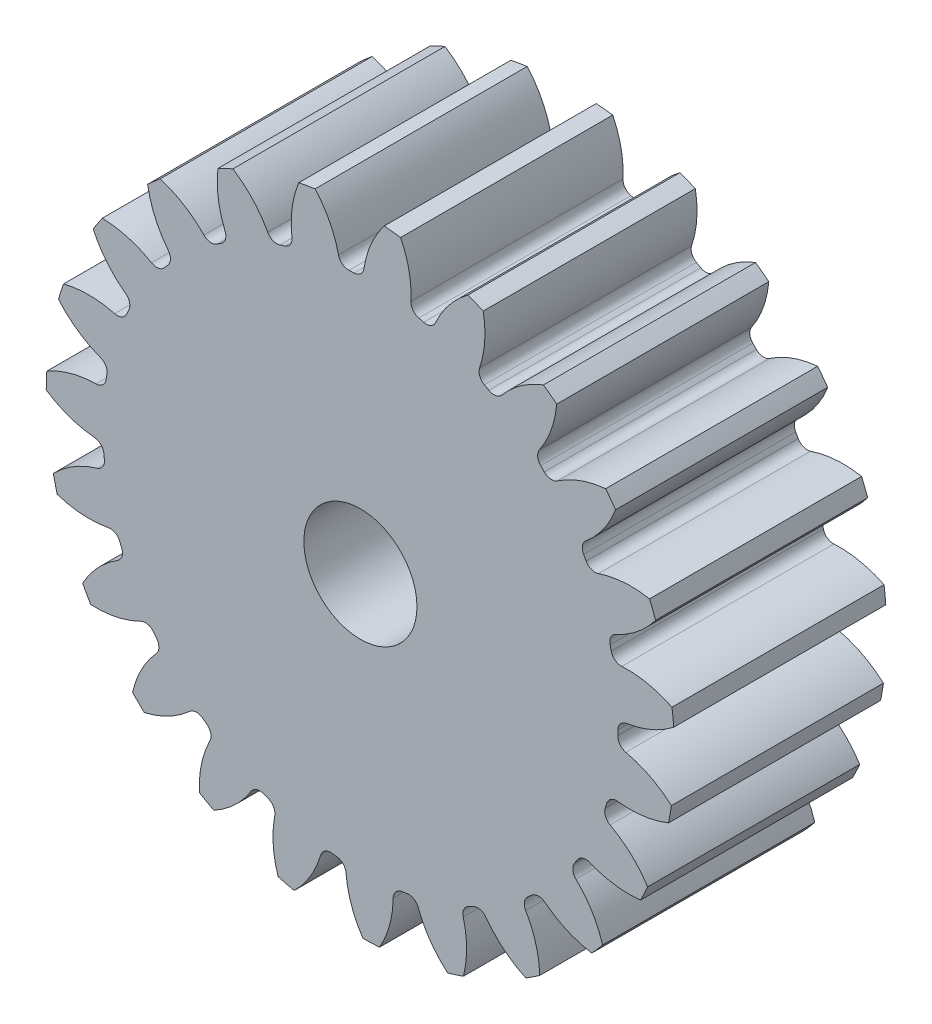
from build123d import *

# Parameters (mm, degrees)
SKETCH3_R         = 141.111111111
GEARBODY_DEPTH    = 95.25
TOOTHCUT_DEPTH    = 222.127234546
CIRPATTERN1_COUNT = 23
BOREDIA_R         = 25.4
BORE_DEPTH        = 12700


with BuildPart() as part:
    # Sketch3 → gearBody (new body)
    with BuildSketch(Plane.XY):
        Circle(SKETCH3_R)
    extrude(amount=GEARBODY_DEPTH)

    # Sketch2 → toothCut (cut, through all)
    with BuildSketch(Plane.XY):
        with BuildLine():
            ThreePointArc((115.600843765, -5.050361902), (115.645165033, -3.906025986), (115.678158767, -2.761307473))
            ThreePointArc((115.678158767, -2.761307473), (116.822024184, 0.164136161), (119.578102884, 1.671013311))
            ThreePointArc((119.578102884, 1.671013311), (130.963143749, 4.969557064), (141.111111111, 11.094775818))
            ThreePointArc((141.111111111, 11.094775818), (141.465928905, -4.778146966), (140.040895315, -20.590953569))
            ThreePointArc((140.040895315, -20.590953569), (130.329354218, -13.794960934), (119.192829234, -9.735729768))
            ThreePointArc((119.192829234, -9.735729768), (116.544708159, -8.046320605), (115.600843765, -5.050361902))
        make_face()
    toothcut = extrude(amount=TOOTHCUT_DEPTH, mode=Mode.SUBTRACT)

    # CirPattern1: toothCut ×23 about axis
    cirpattern1_axis = Axis((0, 0, 0), (0, 0, 1))
    for i in range(1, CIRPATTERN1_COUNT):
        add(toothcut.rotate(cirpattern1_axis, i * 360 / CIRPATTERN1_COUNT), mode=Mode.SUBTRACT)

    # boreDia → bore (cut, symmetric)
    with BuildSketch(Plane.XY):
        Circle(BOREDIA_R)
    extrude(amount=BORE_DEPTH, both=True, mode=Mode.SUBTRACT)


solid = part.part
